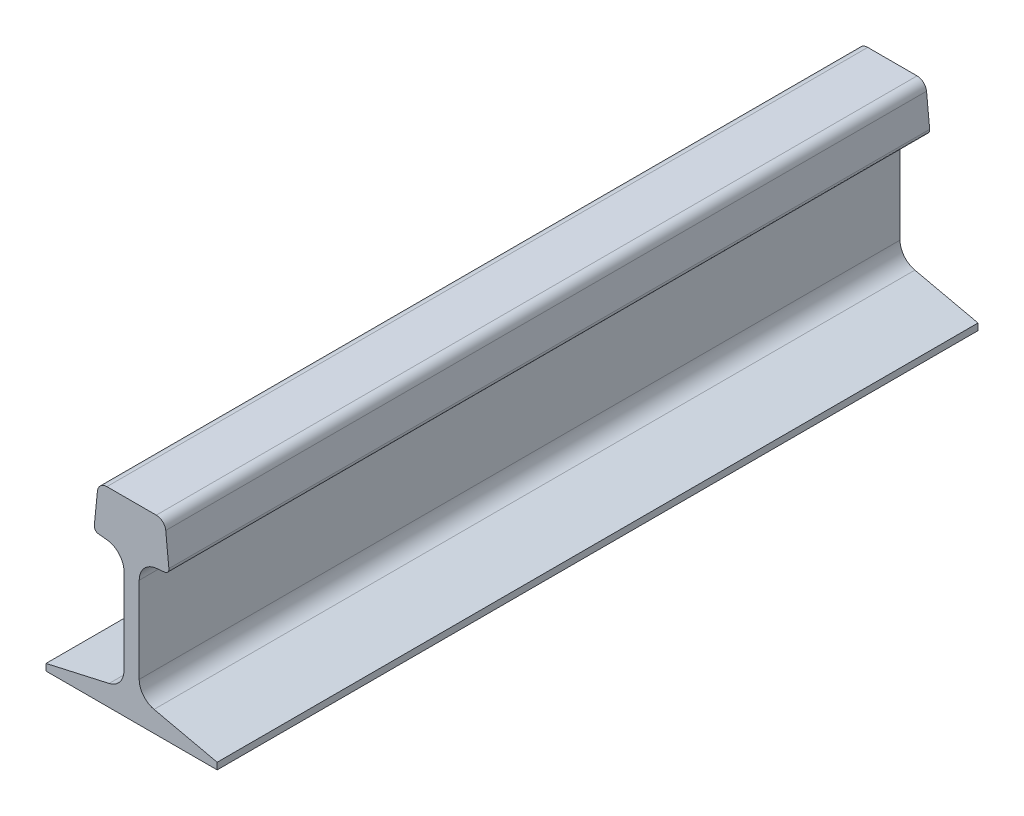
ISO-10303-21;
HEADER;
FILE_DESCRIPTION(('STEP AP214'),'2;1');
FILE_NAME('part.step','',(''),(''),'','','');
FILE_SCHEMA(('AUTOMOTIVE_DESIGN { 1 0 10303 214 1 1 1 1 }'));
ENDSEC;
DATA;
#1=APPLICATION_CONTEXT('core data for automotive mechanical design processes');
#2=APPLICATION_PROTOCOL_DEFINITION('international standard','automotive_design',2000,#1);
#3=PRODUCT_CONTEXT('',#1,'mechanical');
#4=PRODUCT('Part','Part','',(#3));
#5=PRODUCT_RELATED_PRODUCT_CATEGORY('part','',(#4));
#6=PRODUCT_DEFINITION_FORMATION('','',#4);
#7=PRODUCT_DEFINITION_CONTEXT('part definition',#1,'design');
#8=PRODUCT_DEFINITION('design','',#6,#7);
#9=PRODUCT_DEFINITION_SHAPE('','',#8);
#10=(LENGTH_UNIT() NAMED_UNIT(*) SI_UNIT(.MILLI.,.METRE.));
#11=(NAMED_UNIT(*) PLANE_ANGLE_UNIT() SI_UNIT($,.RADIAN.));
#12=(NAMED_UNIT(*) SI_UNIT($,.STERADIAN.) SOLID_ANGLE_UNIT());
#13=UNCERTAINTY_MEASURE_WITH_UNIT(LENGTH_MEASURE(1.E-05),#10,'distance_accuracy_value','');
#14=(GEOMETRIC_REPRESENTATION_CONTEXT(3) GLOBAL_UNCERTAINTY_ASSIGNED_CONTEXT((#13)) GLOBAL_UNIT_ASSIGNED_CONTEXT((#10,
#11,#12)) REPRESENTATION_CONTEXT('',''));
#15=CARTESIAN_POINT('',(0.,0.,0.));
#16=DIRECTION('',(0.,0.,1.));
#17=DIRECTION('',(1.,0.,0.));
#18=AXIS2_PLACEMENT_3D('',#15,#16,#17);
#19=CARTESIAN_POINT('',(-3.53935928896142,161.1048167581,0.));
#20=DIRECTION('',(0.,0.,1.));
#21=DIRECTION('',(1.,0.,0.));
#22=AXIS2_PLACEMENT_3D('',#19,#20,#21);
#23=CYLINDRICAL_SURFACE('',#22,10.);
#24=CARTESIAN_POINT('',(-3.53935928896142,161.1048167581,0.));
#25=DIRECTION('',(0.,0.,1.));
#26=DIRECTION('',(1.,0.,0.));
#27=AXIS2_PLACEMENT_3D('',#24,#25,#26);
#28=CIRCLE('',#27,10.);
#29=CARTESIAN_POINT('',(-3.53935928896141,171.1048167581,0.));
#30=VERTEX_POINT('',#29);
#31=CARTESIAN_POINT('',(-13.4897311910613,162.09985394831,0.));
#32=VERTEX_POINT('',#31);
#33=EDGE_CURVE('E161',#30,#32,#28,.T.);
#34=ORIENTED_EDGE('',*,*,#33,.T.);
#35=DIRECTION('',(0.,0.,1.));
#36=VECTOR('',#35,1.);
#37=CARTESIAN_POINT('',(-13.4897311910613,162.09985394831,0.));
#38=LINE('',#37,#36);
#39=CARTESIAN_POINT('',(-13.4897311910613,162.09985394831,800.));
#40=VERTEX_POINT('',#39);
#41=EDGE_CURVE('E156',#40,#32,#38,.F.);
#42=ORIENTED_EDGE('',*,*,#41,.F.);
#43=CARTESIAN_POINT('',(-3.53935928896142,161.1048167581,800.));
#44=DIRECTION('',(0.,0.,1.));
#45=DIRECTION('',(1.,0.,0.));
#46=AXIS2_PLACEMENT_3D('',#43,#44,#45);
#47=CIRCLE('',#46,10.);
#48=CARTESIAN_POINT('',(-3.53935928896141,171.1048167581,800.));
#49=VERTEX_POINT('',#48);
#50=EDGE_CURVE('E20',#49,#40,#47,.T.);
#51=ORIENTED_EDGE('',*,*,#50,.F.);
#52=DIRECTION('',(0.,0.,1.));
#53=VECTOR('',#52,1.);
#54=CARTESIAN_POINT('',(-3.5393592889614,171.1048167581,0.));
#55=LINE('',#54,#53);
#56=EDGE_CURVE('E151',#30,#49,#55,.T.);
#57=ORIENTED_EDGE('',*,*,#56,.F.);
#58=EDGE_LOOP('',(#34,#42,#51,#57));
#59=FACE_BOUND('',#58,.T.);
#60=ADVANCED_FACE('F16',(#59),#23,.T.);
#61=CARTESIAN_POINT('',(-16.793453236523,129.062633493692,0.));
#62=DIRECTION('',(-0.995037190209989,0.099503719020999,0.));
#63=DIRECTION('',(-0.099503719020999,-0.995037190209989,0.));
#64=AXIS2_PLACEMENT_3D('',#61,#62,#63);
#65=PLANE('',#64);
#66=DIRECTION('',(-0.0995037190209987,-0.995037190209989,0.));
#67=VECTOR('',#66,1.);
#68=CARTESIAN_POINT('',(-13.4897311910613,162.09985394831,0.));
#69=LINE('',#68,#67);
#70=CARTESIAN_POINT('',(-16.793453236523,129.062633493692,0.));
#71=VERTEX_POINT('',#70);
#72=EDGE_CURVE('E214',#32,#71,#69,.T.);
#73=ORIENTED_EDGE('',*,*,#72,.T.);
#74=DIRECTION('',(0.,0.,1.));
#75=VECTOR('',#74,1.);
#76=CARTESIAN_POINT('',(-16.793453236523,129.062633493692,0.));
#77=LINE('',#76,#75);
#78=CARTESIAN_POINT('',(-16.793453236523,129.062633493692,800.));
#79=VERTEX_POINT('',#78);
#80=EDGE_CURVE('E164',#79,#71,#77,.F.);
#81=ORIENTED_EDGE('',*,*,#80,.F.);
#82=DIRECTION('',(-0.0995037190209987,-0.995037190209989,0.));
#83=VECTOR('',#82,1.);
#84=CARTESIAN_POINT('',(-13.4897311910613,162.09985394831,800.));
#85=LINE('',#84,#83);
#86=EDGE_CURVE('E167',#40,#79,#85,.T.);
#87=ORIENTED_EDGE('',*,*,#86,.F.);
#88=ORIENTED_EDGE('',*,*,#41,.T.);
#89=EDGE_LOOP('',(#73,#81,#87,#88));
#90=FACE_BOUND('',#89,.T.);
#91=ADVANCED_FACE('F168',(#90),#65,.T.);
#92=CARTESIAN_POINT('',(-11.818267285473,128.565114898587,0.));
#93=DIRECTION('',(0.,0.,1.));
#94=DIRECTION('',(1.,0.,0.));
#95=AXIS2_PLACEMENT_3D('',#92,#93,#94);
#96=CYLINDRICAL_SURFACE('',#95,5.);
#97=CARTESIAN_POINT('',(-11.818267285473,128.565114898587,0.));
#98=DIRECTION('',(0.,0.,1.));
#99=DIRECTION('',(1.,0.,0.));
#100=AXIS2_PLACEMENT_3D('',#97,#98,#99);
#101=CIRCLE('',#100,5.);
#102=CARTESIAN_POINT('',(-12.3182672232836,123.590177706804,0.));
#103=VERTEX_POINT('',#102);
#104=EDGE_CURVE('E213',#71,#103,#101,.T.);
#105=ORIENTED_EDGE('',*,*,#104,.T.);
#106=DIRECTION('',(0.,0.,1.));
#107=VECTOR('',#106,1.);
#108=CARTESIAN_POINT('',(-12.3182672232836,123.590177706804,0.));
#109=LINE('',#108,#107);
#110=CARTESIAN_POINT('',(-12.3182672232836,123.590177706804,800.));
#111=VERTEX_POINT('',#110);
#112=EDGE_CURVE('E268',#111,#103,#109,.F.);
#113=ORIENTED_EDGE('',*,*,#112,.F.);
#114=CARTESIAN_POINT('',(-11.818267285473,128.565114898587,800.));
#115=DIRECTION('',(0.,0.,1.));
#116=DIRECTION('',(1.,0.,0.));
#117=AXIS2_PLACEMENT_3D('',#114,#115,#116);
#118=CIRCLE('',#117,5.);
#119=EDGE_CURVE('E173',#79,#111,#118,.T.);
#120=ORIENTED_EDGE('',*,*,#119,.F.);
#121=ORIENTED_EDGE('',*,*,#80,.T.);
#122=EDGE_LOOP('',(#105,#113,#120,#121));
#123=FACE_BOUND('',#122,.T.);
#124=ADVANCED_FACE('F391',(#123),#96,.T.);
#125=CARTESIAN_POINT('',(-3.58923515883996,122.712877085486,0.));
#126=DIRECTION('',(-0.099999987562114,-0.994987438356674,0.));
#127=DIRECTION('',(0.994987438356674,-0.099999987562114,0.));
#128=AXIS2_PLACEMENT_3D('',#125,#126,#127);
#129=PLANE('',#128);
#130=DIRECTION('',(0.994987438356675,-0.0999999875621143,0.));
#131=VECTOR('',#130,1.);
#132=CARTESIAN_POINT('',(-12.3182672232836,123.590177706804,0.));
#133=LINE('',#132,#131);
#134=CARTESIAN_POINT('',(-3.58923515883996,122.712877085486,0.));
#135=VERTEX_POINT('',#134);
#136=EDGE_CURVE('E211',#103,#135,#133,.T.);
#137=ORIENTED_EDGE('',*,*,#136,.T.);
#138=DIRECTION('',(0.,0.,1.));
#139=VECTOR('',#138,1.);
#140=CARTESIAN_POINT('',(-3.58923515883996,122.712877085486,0.));
#141=LINE('',#140,#139);
#142=CARTESIAN_POINT('',(-3.58923515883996,122.712877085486,800.));
#143=VERTEX_POINT('',#142);
#144=EDGE_CURVE('E266',#135,#143,#141,.T.);
#145=ORIENTED_EDGE('',*,*,#144,.T.);
#146=DIRECTION('',(0.994987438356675,-0.0999999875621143,0.));
#147=VECTOR('',#146,1.);
#148=CARTESIAN_POINT('',(-12.3182672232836,123.590177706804,800.));
#149=LINE('',#148,#147);
#150=EDGE_CURVE('E318',#111,#143,#149,.T.);
#151=ORIENTED_EDGE('',*,*,#150,.F.);
#152=ORIENTED_EDGE('',*,*,#112,.T.);
#153=EDGE_LOOP('',(#137,#145,#151,#152));
#154=FACE_BOUND('',#153,.T.);
#155=ADVANCED_FACE('F388',(#154),#129,.T.);
#156=CARTESIAN_POINT('',(-5.58923491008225,102.813128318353,0.));
#157=DIRECTION('',(0.,0.,1.));
#158=DIRECTION('',(1.,0.,0.));
#159=AXIS2_PLACEMENT_3D('',#156,#157,#158);
#160=CYLINDRICAL_SURFACE('',#159,20.);
#161=ORIENTED_EDGE('',*,*,#144,.F.);
#162=CARTESIAN_POINT('',(-5.58923491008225,102.813128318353,0.));
#163=DIRECTION('',(0.,0.,1.));
#164=DIRECTION('',(1.,0.,0.));
#165=AXIS2_PLACEMENT_3D('',#162,#163,#164);
#166=CIRCLE('',#165,20.);
#167=CARTESIAN_POINT('',(14.4107650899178,102.813128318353,0.));
#168=VERTEX_POINT('',#167);
#169=EDGE_CURVE('E210',#135,#168,#166,.F.);
#170=ORIENTED_EDGE('',*,*,#169,.T.);
#171=DIRECTION('',(0.,0.,1.));
#172=VECTOR('',#171,1.);
#173=CARTESIAN_POINT('',(14.4107650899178,102.813128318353,0.));
#174=LINE('',#173,#172);
#175=CARTESIAN_POINT('',(14.4107650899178,102.813128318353,800.));
#176=VERTEX_POINT('',#175);
#177=EDGE_CURVE('E263',#176,#168,#174,.F.);
#178=ORIENTED_EDGE('',*,*,#177,.F.);
#179=CARTESIAN_POINT('',(-5.58923491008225,102.813128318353,800.));
#180=DIRECTION('',(0.,0.,1.));
#181=DIRECTION('',(1.,0.,0.));
#182=AXIS2_PLACEMENT_3D('',#179,#180,#181);
#183=CIRCLE('',#182,20.);
#184=EDGE_CURVE('E316',#143,#176,#183,.F.);
#185=ORIENTED_EDGE('',*,*,#184,.F.);
#186=EDGE_LOOP('',(#161,#170,#178,#185));
#187=FACE_BOUND('',#186,.T.);
#188=ADVANCED_FACE('F386',(#187),#160,.F.);
#189=CARTESIAN_POINT('',(14.4107650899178,12.5548167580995,0.));
#190=DIRECTION('',(-1.,0.,0.));
#191=DIRECTION('',(0.,0.,1.));
#192=AXIS2_PLACEMENT_3D('',#189,#190,#191);
#193=PLANE('',#192);
#194=DIRECTION('',(0.,1.,0.));
#195=VECTOR('',#194,1.);
#196=CARTESIAN_POINT('',(14.4107650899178,54.6092742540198,0.));
#197=LINE('',#196,#195);
#198=CARTESIAN_POINT('',(14.4107650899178,12.5548167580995,0.));
#199=VERTEX_POINT('',#198);
#200=EDGE_CURVE('E208',#168,#199,#197,.F.);
#201=ORIENTED_EDGE('',*,*,#200,.T.);
#202=DIRECTION('',(0.,0.,1.));
#203=VECTOR('',#202,1.);
#204=CARTESIAN_POINT('',(14.4107650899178,12.5548167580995,0.));
#205=LINE('',#204,#203);
#206=CARTESIAN_POINT('',(14.4107650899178,12.5548167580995,800.));
#207=VERTEX_POINT('',#206);
#208=EDGE_CURVE('E252',#199,#207,#205,.T.);
#209=ORIENTED_EDGE('',*,*,#208,.T.);
#210=DIRECTION('',(0.,1.,0.));
#211=VECTOR('',#210,1.);
#212=CARTESIAN_POINT('',(14.4107650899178,54.6092742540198,800.));
#213=LINE('',#212,#211);
#214=EDGE_CURVE('E315',#176,#207,#213,.F.);
#215=ORIENTED_EDGE('',*,*,#214,.F.);
#216=ORIENTED_EDGE('',*,*,#177,.T.);
#217=EDGE_LOOP('',(#201,#209,#215,#216));
#218=FACE_BOUND('',#217,.T.);
#219=ADVANCED_FACE('F381',(#218),#193,.T.);
#220=CARTESIAN_POINT('',(-5.58923491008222,12.5548167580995,0.));
#221=DIRECTION('',(0.,0.,1.));
#222=DIRECTION('',(1.,0.,0.));
#223=AXIS2_PLACEMENT_3D('',#220,#221,#222);
#224=CYLINDRICAL_SURFACE('',#223,20.);
#225=ORIENTED_EDGE('',*,*,#208,.F.);
#226=CARTESIAN_POINT('',(-5.58923491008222,12.5548167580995,0.));
#227=DIRECTION('',(0.,0.,1.));
#228=DIRECTION('',(1.,0.,0.));
#229=AXIS2_PLACEMENT_3D('',#226,#227,#228);
#230=CIRCLE('',#229,20.);
#231=CARTESIAN_POINT('',(-1.1989910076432,-6.95737836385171,0.));
#232=VERTEX_POINT('',#231);
#233=EDGE_CURVE('E205',#199,#232,#230,.F.);
#234=ORIENTED_EDGE('',*,*,#233,.T.);
#235=DIRECTION('',(0.,0.,1.));
#236=VECTOR('',#235,1.);
#237=CARTESIAN_POINT('',(-1.1989910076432,-6.9573783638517,0.));
#238=LINE('',#237,#236);
#239=CARTESIAN_POINT('',(-1.1989910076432,-6.95737836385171,800.));
#240=VERTEX_POINT('',#239);
#241=EDGE_CURVE('E239',#240,#232,#238,.F.);
#242=ORIENTED_EDGE('',*,*,#241,.F.);
#243=CARTESIAN_POINT('',(-5.58923491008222,12.5548167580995,800.));
#244=DIRECTION('',(0.,0.,1.));
#245=DIRECTION('',(1.,0.,0.));
#246=AXIS2_PLACEMENT_3D('',#243,#244,#245);
#247=CIRCLE('',#246,20.);
#248=EDGE_CURVE('E311',#207,#240,#247,.F.);
#249=ORIENTED_EDGE('',*,*,#248,.F.);
#250=EDGE_LOOP('',(#225,#234,#242,#249));
#251=FACE_BOUND('',#250,.T.);
#252=ADVANCED_FACE('F376',(#251),#224,.F.);
#253=CARTESIAN_POINT('',(-67.5892349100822,-21.8951832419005,0.));
#254=DIRECTION('',(-0.219512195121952,0.975609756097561,0.));
#255=DIRECTION('',(-0.975609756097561,-0.219512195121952,0.));
#256=AXIS2_PLACEMENT_3D('',#253,#254,#255);
#257=PLANE('',#256);
#258=DIRECTION('',(-0.975609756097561,-0.219512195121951,0.));
#259=VECTOR('',#258,1.);
#260=CARTESIAN_POINT('',(-1.19899100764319,-6.95737836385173,0.));
#261=LINE('',#260,#259);
#262=CARTESIAN_POINT('',(-67.5892349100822,-21.8951832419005,0.));
#263=VERTEX_POINT('',#262);
#264=EDGE_CURVE('E203',#232,#263,#261,.T.);
#265=ORIENTED_EDGE('',*,*,#264,.T.);
#266=DIRECTION('',(0.,0.,1.));
#267=VECTOR('',#266,1.);
#268=CARTESIAN_POINT('',(-67.5892349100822,-21.8951832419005,0.));
#269=LINE('',#268,#267);
#270=CARTESIAN_POINT('',(-67.5892349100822,-21.8951832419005,800.));
#271=VERTEX_POINT('',#270);
#272=EDGE_CURVE('E253',#271,#263,#269,.F.);
#273=ORIENTED_EDGE('',*,*,#272,.F.);
#274=DIRECTION('',(-0.975609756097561,-0.219512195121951,0.));
#275=VECTOR('',#274,1.);
#276=CARTESIAN_POINT('',(-1.19899100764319,-6.95737836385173,800.));
#277=LINE('',#276,#275);
#278=EDGE_CURVE('E314',#240,#271,#277,.T.);
#279=ORIENTED_EDGE('',*,*,#278,.F.);
#280=ORIENTED_EDGE('',*,*,#241,.T.);
#281=EDGE_LOOP('',(#265,#273,#279,#280));
#282=FACE_BOUND('',#281,.T.);
#283=ADVANCED_FACE('F372',(#282),#257,.T.);
#284=CARTESIAN_POINT('',(50.4107650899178,12.5548167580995,0.));
#285=DIRECTION('',(0.,0.,1.));
#286=DIRECTION('',(1.,0.,0.));
#287=AXIS2_PLACEMENT_3D('',#284,#285,#286);
#288=CYLINDRICAL_SURFACE('',#287,20.);
#289=DIRECTION('',(0.,0.,1.));
#290=VECTOR('',#289,1.);
#291=CARTESIAN_POINT('',(46.0205211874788,-6.95737836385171,0.));
#292=LINE('',#291,#290);
#293=CARTESIAN_POINT('',(46.0205211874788,-6.95737836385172,0.));
#294=VERTEX_POINT('',#293);
#295=CARTESIAN_POINT('',(46.0205211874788,-6.95737836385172,800.));
#296=VERTEX_POINT('',#295);
#297=EDGE_CURVE('E179',#294,#296,#292,.T.);
#298=ORIENTED_EDGE('',*,*,#297,.F.);
#299=CARTESIAN_POINT('',(50.4107650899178,12.5548167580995,0.));
#300=DIRECTION('',(0.,0.,1.));
#301=DIRECTION('',(1.,0.,0.));
#302=AXIS2_PLACEMENT_3D('',#299,#300,#301);
#303=CIRCLE('',#302,20.);
#304=CARTESIAN_POINT('',(30.4107650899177,12.5548167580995,0.));
#305=VERTEX_POINT('',#304);
#306=EDGE_CURVE('E196',#294,#305,#303,.F.);
#307=ORIENTED_EDGE('',*,*,#306,.T.);
#308=DIRECTION('',(0.,0.,-1.));
#309=VECTOR('',#308,1.);
#310=CARTESIAN_POINT('',(30.4107650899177,12.5548167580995,0.));
#311=LINE('',#310,#309);
#312=CARTESIAN_POINT('',(30.4107650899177,12.5548167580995,800.));
#313=VERTEX_POINT('',#312);
#314=EDGE_CURVE('E237',#313,#305,#311,.T.);
#315=ORIENTED_EDGE('',*,*,#314,.F.);
#316=CARTESIAN_POINT('',(50.4107650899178,12.5548167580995,800.));
#317=DIRECTION('',(0.,0.,1.));
#318=DIRECTION('',(1.,0.,0.));
#319=AXIS2_PLACEMENT_3D('',#316,#317,#318);
#320=CIRCLE('',#319,20.);
#321=EDGE_CURVE('E307',#296,#313,#320,.F.);
#322=ORIENTED_EDGE('',*,*,#321,.F.);
#323=EDGE_LOOP('',(#298,#307,#315,#322));
#324=FACE_BOUND('',#323,.T.);
#325=ADVANCED_FACE('F409',(#324),#288,.F.);
#326=CARTESIAN_POINT('',(30.4107650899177,102.813128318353,0.));
#327=DIRECTION('',(1.,0.,0.));
#328=DIRECTION('',(0.,0.,-1.));
#329=AXIS2_PLACEMENT_3D('',#326,#327,#328);
#330=PLANE('',#329);
#331=DIRECTION('',(0.,1.,0.));
#332=VECTOR('',#331,1.);
#333=CARTESIAN_POINT('',(30.4107650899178,54.6092742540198,0.));
#334=LINE('',#333,#332);
#335=CARTESIAN_POINT('',(30.4107650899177,102.813128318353,0.));
#336=VERTEX_POINT('',#335);
#337=EDGE_CURVE('E194',#305,#336,#334,.T.);
#338=ORIENTED_EDGE('',*,*,#337,.T.);
#339=DIRECTION('',(0.,0.,1.));
#340=VECTOR('',#339,1.);
#341=CARTESIAN_POINT('',(30.4107650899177,102.813128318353,0.));
#342=LINE('',#341,#340);
#343=CARTESIAN_POINT('',(30.4107650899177,102.813128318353,800.));
#344=VERTEX_POINT('',#343);
#345=EDGE_CURVE('E235',#336,#344,#342,.T.);
#346=ORIENTED_EDGE('',*,*,#345,.T.);
#347=DIRECTION('',(0.,1.,0.));
#348=VECTOR('',#347,1.);
#349=CARTESIAN_POINT('',(30.4107650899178,54.6092742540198,800.));
#350=LINE('',#349,#348);
#351=EDGE_CURVE('E306',#313,#344,#350,.T.);
#352=ORIENTED_EDGE('',*,*,#351,.F.);
#353=ORIENTED_EDGE('',*,*,#314,.T.);
#354=EDGE_LOOP('',(#338,#346,#352,#353));
#355=FACE_BOUND('',#354,.T.);
#356=ADVANCED_FACE('F412',(#355),#330,.T.);
#357=CARTESIAN_POINT('',(50.4107650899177,102.813128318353,0.));
#358=DIRECTION('',(0.,0.,1.));
#359=DIRECTION('',(1.,0.,0.));
#360=AXIS2_PLACEMENT_3D('',#357,#358,#359);
#361=CYLINDRICAL_SURFACE('',#360,20.);
#362=ORIENTED_EDGE('',*,*,#345,.F.);
#363=CARTESIAN_POINT('',(50.4107650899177,102.813128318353,0.));
#364=DIRECTION('',(0.,0.,1.));
#365=DIRECTION('',(1.,0.,0.));
#366=AXIS2_PLACEMENT_3D('',#363,#364,#365);
#367=CIRCLE('',#366,20.);
#368=CARTESIAN_POINT('',(48.4107653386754,122.712877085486,0.));
#369=VERTEX_POINT('',#368);
#370=EDGE_CURVE('E193',#336,#369,#367,.F.);
#371=ORIENTED_EDGE('',*,*,#370,.T.);
#372=DIRECTION('',(0.,0.,1.));
#373=VECTOR('',#372,1.);
#374=CARTESIAN_POINT('',(48.4107653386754,122.712877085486,0.));
#375=LINE('',#374,#373);
#376=CARTESIAN_POINT('',(48.4107653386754,122.712877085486,800.));
#377=VERTEX_POINT('',#376);
#378=EDGE_CURVE('E232',#377,#369,#375,.F.);
#379=ORIENTED_EDGE('',*,*,#378,.F.);
#380=CARTESIAN_POINT('',(50.4107650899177,102.813128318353,800.));
#381=DIRECTION('',(0.,0.,1.));
#382=DIRECTION('',(1.,0.,0.));
#383=AXIS2_PLACEMENT_3D('',#380,#381,#382);
#384=CIRCLE('',#383,20.);
#385=EDGE_CURVE('E303',#344,#377,#384,.F.);
#386=ORIENTED_EDGE('',*,*,#385,.F.);
#387=EDGE_LOOP('',(#362,#371,#379,#386));
#388=FACE_BOUND('',#387,.T.);
#389=ADVANCED_FACE('F416',(#388),#361,.F.);
#390=CARTESIAN_POINT('',(57.1397974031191,123.590177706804,0.));
#391=DIRECTION('',(0.099999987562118,-0.994987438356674,0.));
#392=DIRECTION('',(0.994987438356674,0.099999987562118,0.));
#393=AXIS2_PLACEMENT_3D('',#390,#391,#392);
#394=PLANE('',#393);
#395=DIRECTION('',(0.994987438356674,0.0999999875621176,0.));
#396=VECTOR('',#395,1.);
#397=CARTESIAN_POINT('',(48.4107653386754,122.712877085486,0.));
#398=LINE('',#397,#396);
#399=CARTESIAN_POINT('',(57.1397974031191,123.590177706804,0.));
#400=VERTEX_POINT('',#399);
#401=EDGE_CURVE('E191',#369,#400,#398,.T.);
#402=ORIENTED_EDGE('',*,*,#401,.T.);
#403=DIRECTION('',(0.,0.,1.));
#404=VECTOR('',#403,1.);
#405=CARTESIAN_POINT('',(57.1397974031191,123.590177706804,0.));
#406=LINE('',#405,#404);
#407=CARTESIAN_POINT('',(57.1397974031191,123.590177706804,800.));
#408=VERTEX_POINT('',#407);
#409=EDGE_CURVE('E229',#408,#400,#406,.F.);
#410=ORIENTED_EDGE('',*,*,#409,.F.);
#411=DIRECTION('',(0.994987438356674,0.0999999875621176,0.));
#412=VECTOR('',#411,1.);
#413=CARTESIAN_POINT('',(48.4107653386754,122.712877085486,800.));
#414=LINE('',#413,#412);
#415=EDGE_CURVE('E302',#377,#408,#414,.T.);
#416=ORIENTED_EDGE('',*,*,#415,.F.);
#417=ORIENTED_EDGE('',*,*,#378,.T.);
#418=EDGE_LOOP('',(#402,#410,#416,#417));
#419=FACE_BOUND('',#418,.T.);
#420=ADVANCED_FACE('F420',(#419),#394,.T.);
#421=CARTESIAN_POINT('',(56.6397974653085,128.565114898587,0.));
#422=DIRECTION('',(0.,0.,1.));
#423=DIRECTION('',(1.,0.,0.));
#424=AXIS2_PLACEMENT_3D('',#421,#422,#423);
#425=CYLINDRICAL_SURFACE('',#424,5.);
#426=CARTESIAN_POINT('',(56.6397974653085,128.565114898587,0.));
#427=DIRECTION('',(0.,0.,1.));
#428=DIRECTION('',(1.,0.,0.));
#429=AXIS2_PLACEMENT_3D('',#426,#427,#428);
#430=CIRCLE('',#429,5.);
#431=CARTESIAN_POINT('',(61.6149834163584,129.062633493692,0.));
#432=VERTEX_POINT('',#431);
#433=EDGE_CURVE('E190',#400,#432,#430,.T.);
#434=ORIENTED_EDGE('',*,*,#433,.T.);
#435=DIRECTION('',(0.,0.,1.));
#436=VECTOR('',#435,1.);
#437=CARTESIAN_POINT('',(61.6149834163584,129.062633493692,0.));
#438=LINE('',#437,#436);
#439=CARTESIAN_POINT('',(61.6149834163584,129.062633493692,800.));
#440=VERTEX_POINT('',#439);
#441=EDGE_CURVE('E226',#440,#432,#438,.F.);
#442=ORIENTED_EDGE('',*,*,#441,.F.);
#443=CARTESIAN_POINT('',(56.6397974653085,128.565114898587,800.));
#444=DIRECTION('',(0.,0.,1.));
#445=DIRECTION('',(1.,0.,0.));
#446=AXIS2_PLACEMENT_3D('',#443,#444,#445);
#447=CIRCLE('',#446,5.);
#448=EDGE_CURVE('E299',#408,#440,#447,.T.);
#449=ORIENTED_EDGE('',*,*,#448,.F.);
#450=ORIENTED_EDGE('',*,*,#409,.T.);
#451=EDGE_LOOP('',(#434,#442,#449,#450));
#452=FACE_BOUND('',#451,.T.);
#453=ADVANCED_FACE('F424',(#452),#425,.T.);
#454=CARTESIAN_POINT('',(58.3112613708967,162.09985394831,0.));
#455=DIRECTION('',(0.995037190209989,0.099503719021,0.));
#456=DIRECTION('',(-0.099503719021,0.995037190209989,0.));
#457=AXIS2_PLACEMENT_3D('',#454,#455,#456);
#458=PLANE('',#457);
#459=DIRECTION('',(-0.0995037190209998,0.995037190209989,0.));
#460=VECTOR('',#459,1.);
#461=CARTESIAN_POINT('',(61.6149834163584,129.062633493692,0.));
#462=LINE('',#461,#460);
#463=CARTESIAN_POINT('',(58.3112613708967,162.09985394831,0.));
#464=VERTEX_POINT('',#463);
#465=EDGE_CURVE('E188',#432,#464,#462,.T.);
#466=ORIENTED_EDGE('',*,*,#465,.T.);
#467=DIRECTION('',(0.,0.,1.));
#468=VECTOR('',#467,1.);
#469=CARTESIAN_POINT('',(58.3112613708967,162.09985394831,0.));
#470=LINE('',#469,#468);
#471=CARTESIAN_POINT('',(58.3112613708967,162.09985394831,800.));
#472=VERTEX_POINT('',#471);
#473=EDGE_CURVE('E222',#472,#464,#470,.F.);
#474=ORIENTED_EDGE('',*,*,#473,.F.);
#475=DIRECTION('',(-0.0995037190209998,0.995037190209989,0.));
#476=VECTOR('',#475,1.);
#477=CARTESIAN_POINT('',(61.6149834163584,129.062633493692,800.));
#478=LINE('',#477,#476);
#479=EDGE_CURVE('E298',#440,#472,#478,.T.);
#480=ORIENTED_EDGE('',*,*,#479,.F.);
#481=ORIENTED_EDGE('',*,*,#441,.T.);
#482=EDGE_LOOP('',(#466,#474,#480,#481));
#483=FACE_BOUND('',#482,.T.);
#484=ADVANCED_FACE('F339',(#483),#458,.T.);
#485=CARTESIAN_POINT('',(48.3608894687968,161.1048167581,0.));
#486=DIRECTION('',(0.,0.,1.));
#487=DIRECTION('',(1.,0.,0.));
#488=AXIS2_PLACEMENT_3D('',#485,#486,#487);
#489=CYLINDRICAL_SURFACE('',#488,10.);
#490=CARTESIAN_POINT('',(48.3608894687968,161.1048167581,0.));
#491=DIRECTION('',(0.,0.,1.));
#492=DIRECTION('',(1.,0.,0.));
#493=AXIS2_PLACEMENT_3D('',#490,#491,#492);
#494=CIRCLE('',#493,10.);
#495=CARTESIAN_POINT('',(48.3608894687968,171.1048167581,0.));
#496=VERTEX_POINT('',#495);
#497=EDGE_CURVE('E187',#464,#496,#494,.T.);
#498=ORIENTED_EDGE('',*,*,#497,.T.);
#499=DIRECTION('',(0.,0.,1.));
#500=VECTOR('',#499,1.);
#501=CARTESIAN_POINT('',(48.3608894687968,171.1048167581,0.));
#502=LINE('',#501,#500);
#503=CARTESIAN_POINT('',(48.3608894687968,171.1048167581,800.));
#504=VERTEX_POINT('',#503);
#505=EDGE_CURVE('E219',#504,#496,#502,.F.);
#506=ORIENTED_EDGE('',*,*,#505,.F.);
#507=CARTESIAN_POINT('',(48.3608894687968,161.1048167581,800.));
#508=DIRECTION('',(0.,0.,1.));
#509=DIRECTION('',(1.,0.,0.));
#510=AXIS2_PLACEMENT_3D('',#507,#508,#509);
#511=CIRCLE('',#510,10.);
#512=EDGE_CURVE('E274',#472,#504,#511,.T.);
#513=ORIENTED_EDGE('',*,*,#512,.F.);
#514=ORIENTED_EDGE('',*,*,#473,.T.);
#515=EDGE_LOOP('',(#498,#506,#513,#514));
#516=FACE_BOUND('',#515,.T.);
#517=ADVANCED_FACE('F343',(#516),#489,.T.);
#518=CARTESIAN_POINT('',(22.4107650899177,171.1048167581,0.));
#519=DIRECTION('',(0.,1.,0.));
#520=DIRECTION('',(0.,0.,1.));
#521=AXIS2_PLACEMENT_3D('',#518,#519,#520);
#522=PLANE('',#521);
#523=DIRECTION('',(1.,0.,0.));
#524=VECTOR('',#523,1.);
#525=CARTESIAN_POINT('',(1.34173413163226,171.1048167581,0.));
#526=LINE('',#525,#524);
#527=EDGE_CURVE('E184',#496,#30,#526,.F.);
#528=ORIENTED_EDGE('',*,*,#527,.T.);
#529=ORIENTED_EDGE('',*,*,#56,.T.);
#530=DIRECTION('',(1.,0.,0.));
#531=VECTOR('',#530,1.);
#532=CARTESIAN_POINT('',(1.34173413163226,171.1048167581,800.));
#533=LINE('',#532,#531);
#534=EDGE_CURVE('E178',#504,#49,#533,.F.);
#535=ORIENTED_EDGE('',*,*,#534,.F.);
#536=ORIENTED_EDGE('',*,*,#505,.T.);
#537=EDGE_LOOP('',(#528,#529,#535,#536));
#538=FACE_BOUND('',#537,.T.);
#539=ADVANCED_FACE('F345',(#538),#522,.T.);
#540=CARTESIAN_POINT('',(46.0205211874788,-6.95737836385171,0.));
#541=DIRECTION('',(0.21951219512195,0.975609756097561,0.));
#542=DIRECTION('',(-0.975609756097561,0.21951219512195,0.));
#543=AXIS2_PLACEMENT_3D('',#540,#541,#542);
#544=PLANE('',#543);
#545=DIRECTION('',(-0.975609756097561,0.21951219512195,0.));
#546=VECTOR('',#545,1.);
#547=CARTESIAN_POINT('',(112.410765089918,-21.8951832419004,0.));
#548=LINE('',#547,#546);
#549=CARTESIAN_POINT('',(112.410765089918,-21.8951832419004,0.));
#550=VERTEX_POINT('',#549);
#551=EDGE_CURVE('E197',#550,#294,#548,.T.);
#552=ORIENTED_EDGE('',*,*,#551,.T.);
#553=ORIENTED_EDGE('',*,*,#297,.T.);
#554=DIRECTION('',(-0.975609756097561,0.21951219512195,0.));
#555=VECTOR('',#554,1.);
#556=CARTESIAN_POINT('',(112.410765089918,-21.8951832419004,800.));
#557=LINE('',#556,#555);
#558=CARTESIAN_POINT('',(112.410765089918,-21.8951832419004,800.));
#559=VERTEX_POINT('',#558);
#560=EDGE_CURVE('E310',#559,#296,#557,.T.);
#561=ORIENTED_EDGE('',*,*,#560,.F.);
#562=DIRECTION('',(0.,0.,-1.));
#563=VECTOR('',#562,1.);
#564=CARTESIAN_POINT('',(112.410765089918,-21.8951832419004,0.));
#565=LINE('',#564,#563);
#566=EDGE_CURVE('E241',#550,#559,#565,.F.);
#567=ORIENTED_EDGE('',*,*,#566,.F.);
#568=EDGE_LOOP('',(#552,#553,#561,#567));
#569=FACE_BOUND('',#568,.T.);
#570=ADVANCED_FACE('F347',(#569),#544,.T.);
#571=CARTESIAN_POINT('',(1.34173413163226,54.6092742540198,800.));
#572=DIRECTION('',(0.,0.,1.));
#573=DIRECTION('',(1.,0.,0.));
#574=AXIS2_PLACEMENT_3D('',#571,#572,#573);
#575=PLANE('',#574);
#576=ORIENTED_EDGE('',*,*,#479,.T.);
#577=ORIENTED_EDGE('',*,*,#512,.T.);
#578=ORIENTED_EDGE('',*,*,#534,.T.);
#579=ORIENTED_EDGE('',*,*,#50,.T.);
#580=ORIENTED_EDGE('',*,*,#86,.T.);
#581=ORIENTED_EDGE('',*,*,#119,.T.);
#582=ORIENTED_EDGE('',*,*,#150,.T.);
#583=ORIENTED_EDGE('',*,*,#184,.T.);
#584=ORIENTED_EDGE('',*,*,#214,.T.);
#585=ORIENTED_EDGE('',*,*,#248,.T.);
#586=ORIENTED_EDGE('',*,*,#278,.T.);
#587=DIRECTION('',(0.,1.,0.));
#588=VECTOR('',#587,1.);
#589=CARTESIAN_POINT('',(-67.5892349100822,-28.8951832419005,800.));
#590=LINE('',#589,#588);
#591=CARTESIAN_POINT('',(-67.5892349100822,-28.8951832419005,800.));
#592=VERTEX_POINT('',#591);
#593=EDGE_CURVE('E256',#592,#271,#590,.T.);
#594=ORIENTED_EDGE('',*,*,#593,.F.);
#595=DIRECTION('',(1.,0.,0.));
#596=VECTOR('',#595,1.);
#597=CARTESIAN_POINT('',(22.4107650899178,-28.8951832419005,800.));
#598=LINE('',#597,#596);
#599=CARTESIAN_POINT('',(112.410765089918,-28.8951832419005,800.));
#600=VERTEX_POINT('',#599);
#601=EDGE_CURVE('E244',#600,#592,#598,.F.);
#602=ORIENTED_EDGE('',*,*,#601,.F.);
#603=DIRECTION('',(0.,1.,0.));
#604=VECTOR('',#603,1.);
#605=CARTESIAN_POINT('',(112.410765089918,-21.8951832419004,800.));
#606=LINE('',#605,#604);
#607=EDGE_CURVE('E186',#559,#600,#606,.F.);
#608=ORIENTED_EDGE('',*,*,#607,.F.);
#609=ORIENTED_EDGE('',*,*,#560,.T.);
#610=ORIENTED_EDGE('',*,*,#321,.T.);
#611=ORIENTED_EDGE('',*,*,#351,.T.);
#612=ORIENTED_EDGE('',*,*,#385,.T.);
#613=ORIENTED_EDGE('',*,*,#415,.T.);
#614=ORIENTED_EDGE('',*,*,#448,.T.);
#615=EDGE_LOOP('',(#576,#577,#578,#579,#580,#581,#582,#583,#584,#585,#586,#594,#602,#608,#609,
#610,#611,#612,#613,#614));
#616=FACE_BOUND('',#615,.T.);
#617=ADVANCED_FACE('F176',(#616),#575,.T.);
#618=CARTESIAN_POINT('',(-67.5892349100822,-28.8951832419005,0.));
#619=DIRECTION('',(-1.,0.,0.));
#620=DIRECTION('',(0.,0.,1.));
#621=AXIS2_PLACEMENT_3D('',#618,#619,#620);
#622=PLANE('',#621);
#623=DIRECTION('',(0.,1.,0.));
#624=VECTOR('',#623,1.);
#625=CARTESIAN_POINT('',(-67.5892349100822,54.6092742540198,0.));
#626=LINE('',#625,#624);
#627=CARTESIAN_POINT('',(-67.5892349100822,-28.8951832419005,0.));
#628=VERTEX_POINT('',#627);
#629=EDGE_CURVE('E200',#263,#628,#626,.F.);
#630=ORIENTED_EDGE('',*,*,#629,.T.);
#631=DIRECTION('',(0.,0.,-1.));
#632=VECTOR('',#631,1.);
#633=CARTESIAN_POINT('',(-67.5892349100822,-28.8951832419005,0.));
#634=LINE('',#633,#632);
#635=EDGE_CURVE('E218',#592,#628,#634,.T.);
#636=ORIENTED_EDGE('',*,*,#635,.F.);
#637=ORIENTED_EDGE('',*,*,#593,.T.);
#638=ORIENTED_EDGE('',*,*,#272,.T.);
#639=EDGE_LOOP('',(#630,#636,#637,#638));
#640=FACE_BOUND('',#639,.T.);
#641=ADVANCED_FACE('F368',(#640),#622,.T.);
#642=CARTESIAN_POINT('',(1.34173413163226,54.6092742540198,0.));
#643=DIRECTION('',(0.,0.,1.));
#644=DIRECTION('',(1.,0.,0.));
#645=AXIS2_PLACEMENT_3D('',#642,#643,#644);
#646=PLANE('',#645);
#647=ORIENTED_EDGE('',*,*,#497,.F.);
#648=ORIENTED_EDGE('',*,*,#465,.F.);
#649=ORIENTED_EDGE('',*,*,#433,.F.);
#650=ORIENTED_EDGE('',*,*,#401,.F.);
#651=ORIENTED_EDGE('',*,*,#370,.F.);
#652=ORIENTED_EDGE('',*,*,#337,.F.);
#653=ORIENTED_EDGE('',*,*,#306,.F.);
#654=ORIENTED_EDGE('',*,*,#551,.F.);
#655=DIRECTION('',(0.,1.,0.));
#656=VECTOR('',#655,1.);
#657=CARTESIAN_POINT('',(112.410765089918,-21.8951832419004,0.));
#658=LINE('',#657,#656);
#659=CARTESIAN_POINT('',(112.410765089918,-28.8951832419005,0.));
#660=VERTEX_POINT('',#659);
#661=EDGE_CURVE('E35',#660,#550,#658,.T.);
#662=ORIENTED_EDGE('',*,*,#661,.F.);
#663=DIRECTION('',(1.,0.,0.));
#664=VECTOR('',#663,1.);
#665=CARTESIAN_POINT('',(22.4107650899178,-28.8951832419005,0.));
#666=LINE('',#665,#664);
#667=EDGE_CURVE('E26',#628,#660,#666,.T.);
#668=ORIENTED_EDGE('',*,*,#667,.F.);
#669=ORIENTED_EDGE('',*,*,#629,.F.);
#670=ORIENTED_EDGE('',*,*,#264,.F.);
#671=ORIENTED_EDGE('',*,*,#233,.F.);
#672=ORIENTED_EDGE('',*,*,#200,.F.);
#673=ORIENTED_EDGE('',*,*,#169,.F.);
#674=ORIENTED_EDGE('',*,*,#136,.F.);
#675=ORIENTED_EDGE('',*,*,#104,.F.);
#676=ORIENTED_EDGE('',*,*,#72,.F.);
#677=ORIENTED_EDGE('',*,*,#33,.F.);
#678=ORIENTED_EDGE('',*,*,#527,.F.);
#679=EDGE_LOOP('',(#647,#648,#649,#650,#651,#652,#653,#654,#662,#668,#669,#670,#671,#672,#673,
#674,#675,#676,#677,#678));
#680=FACE_BOUND('',#679,.T.);
#681=ADVANCED_FACE('F361',(#680),#646,.F.);
#682=CARTESIAN_POINT('',(112.410765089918,-21.8951832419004,0.));
#683=DIRECTION('',(1.,0.,0.));
#684=DIRECTION('',(0.,0.,-1.));
#685=AXIS2_PLACEMENT_3D('',#682,#683,#684);
#686=PLANE('',#685);
#687=ORIENTED_EDGE('',*,*,#661,.T.);
#688=ORIENTED_EDGE('',*,*,#566,.T.);
#689=ORIENTED_EDGE('',*,*,#607,.T.);
#690=DIRECTION('',(0.,0.,-1.));
#691=VECTOR('',#690,1.);
#692=CARTESIAN_POINT('',(112.410765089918,-28.8951832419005,0.));
#693=LINE('',#692,#691);
#694=EDGE_CURVE('E10',#660,#600,#693,.F.);
#695=ORIENTED_EDGE('',*,*,#694,.F.);
#696=EDGE_LOOP('',(#687,#688,#689,#695));
#697=FACE_BOUND('',#696,.T.);
#698=ADVANCED_FACE('F357',(#697),#686,.T.);
#699=CARTESIAN_POINT('',(22.4107650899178,-28.8951832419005,0.));
#700=DIRECTION('',(0.,-1.,0.));
#701=DIRECTION('',(0.,0.,-1.));
#702=AXIS2_PLACEMENT_3D('',#699,#700,#701);
#703=PLANE('',#702);
#704=ORIENTED_EDGE('',*,*,#667,.T.);
#705=ORIENTED_EDGE('',*,*,#694,.T.);
#706=ORIENTED_EDGE('',*,*,#601,.T.);
#707=ORIENTED_EDGE('',*,*,#635,.T.);
#708=EDGE_LOOP('',(#704,#705,#706,#707));
#709=FACE_BOUND('',#708,.T.);
#710=ADVANCED_FACE('F18',(#709),#703,.T.);
#711=CLOSED_SHELL('',(#60,#91,#124,#155,#188,#219,#252,#283,#325,#356,#389,#420,#453,#484,#517,
#539,#570,#617,#641,#681,#698,#710));
#712=MANIFOLD_SOLID_BREP('B1',#711);
#713=ADVANCED_BREP_SHAPE_REPRESENTATION('',(#18,#712),#14);
#714=SHAPE_DEFINITION_REPRESENTATION(#9,#713);
ENDSEC;
END-ISO-10303-21;
